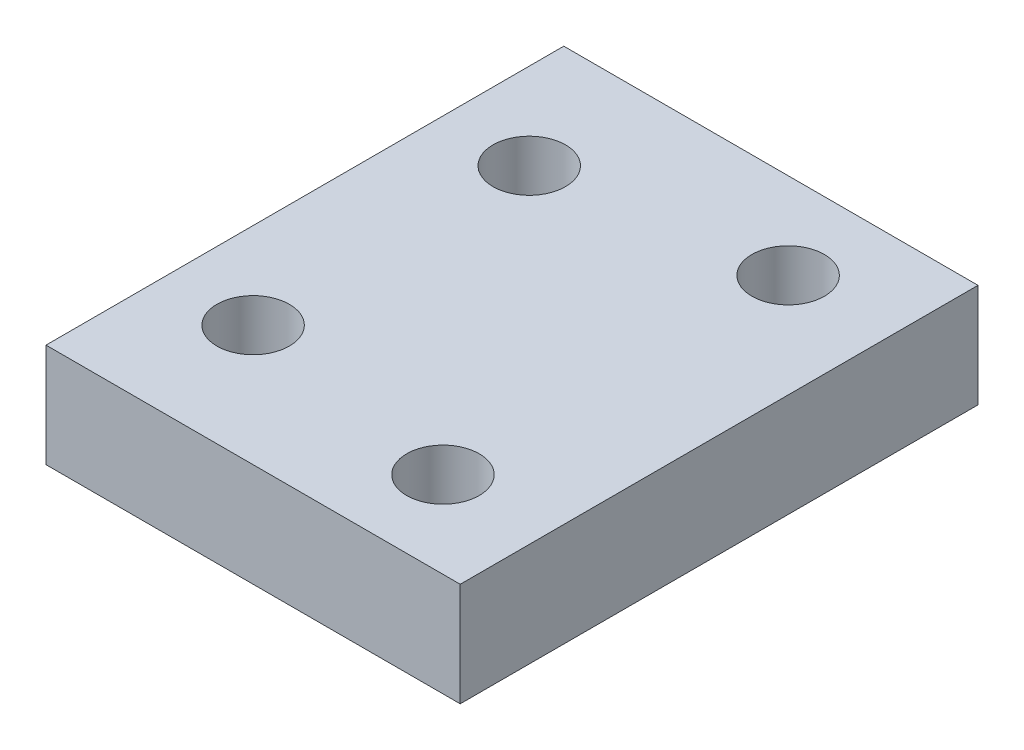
ISO-10303-21;
HEADER;
FILE_DESCRIPTION(('STEP AP214'),'2;1');
FILE_NAME('part.step','',(''),(''),'','','');
FILE_SCHEMA(('AUTOMOTIVE_DESIGN { 1 0 10303 214 1 1 1 1 }'));
ENDSEC;
DATA;
#1=APPLICATION_CONTEXT('core data for automotive mechanical design processes');
#2=APPLICATION_PROTOCOL_DEFINITION('international standard','automotive_design',2000,#1);
#3=PRODUCT_CONTEXT('',#1,'mechanical');
#4=PRODUCT('Part','Part','',(#3));
#5=PRODUCT_RELATED_PRODUCT_CATEGORY('part','',(#4));
#6=PRODUCT_DEFINITION_FORMATION('','',#4);
#7=PRODUCT_DEFINITION_CONTEXT('part definition',#1,'design');
#8=PRODUCT_DEFINITION('design','',#6,#7);
#9=PRODUCT_DEFINITION_SHAPE('','',#8);
#10=(LENGTH_UNIT() NAMED_UNIT(*) SI_UNIT(.MILLI.,.METRE.));
#11=(NAMED_UNIT(*) PLANE_ANGLE_UNIT() SI_UNIT($,.RADIAN.));
#12=(NAMED_UNIT(*) SI_UNIT($,.STERADIAN.) SOLID_ANGLE_UNIT());
#13=UNCERTAINTY_MEASURE_WITH_UNIT(LENGTH_MEASURE(1.E-05),#10,'distance_accuracy_value','');
#14=(GEOMETRIC_REPRESENTATION_CONTEXT(3) GLOBAL_UNCERTAINTY_ASSIGNED_CONTEXT((#13)) GLOBAL_UNIT_ASSIGNED_CONTEXT((#10,
#11,#12)) REPRESENTATION_CONTEXT('',''));
#15=CARTESIAN_POINT('',(0.,0.,0.));
#16=DIRECTION('',(0.,0.,1.));
#17=DIRECTION('',(1.,0.,0.));
#18=AXIS2_PLACEMENT_3D('',#15,#16,#17);
#19=CARTESIAN_POINT('',(0.,6.,0.));
#20=DIRECTION('',(0.,-1.,0.));
#21=DIRECTION('',(0.,0.,-1.));
#22=AXIS2_PLACEMENT_3D('',#19,#20,#21);
#23=PLANE('',#22);
#24=DIRECTION('',(0.,0.,-1.));
#25=VECTOR('',#24,1.);
#26=CARTESIAN_POINT('',(0.,6.,0.));
#27=LINE('',#26,#25);
#28=CARTESIAN_POINT('',(0.,6.,30.));
#29=VERTEX_POINT('',#28);
#30=CARTESIAN_POINT('',(0.,6.,0.));
#31=VERTEX_POINT('',#30);
#32=EDGE_CURVE('E88',#29,#31,#27,.T.);
#33=ORIENTED_EDGE('',*,*,#32,.T.);
#34=DIRECTION('',(-1.,0.,0.));
#35=VECTOR('',#34,1.);
#36=CARTESIAN_POINT('',(0.,6.,0.));
#37=LINE('',#36,#35);
#38=CARTESIAN_POINT('',(-24.,6.,0.));
#39=VERTEX_POINT('',#38);
#40=EDGE_CURVE('E83',#31,#39,#37,.T.);
#41=ORIENTED_EDGE('',*,*,#40,.T.);
#42=DIRECTION('',(0.,0.,1.));
#43=VECTOR('',#42,1.);
#44=CARTESIAN_POINT('',(-24.,6.,0.));
#45=LINE('',#44,#43);
#46=CARTESIAN_POINT('',(-24.,6.,30.));
#47=VERTEX_POINT('',#46);
#48=EDGE_CURVE('E86',#39,#47,#45,.T.);
#49=ORIENTED_EDGE('',*,*,#48,.T.);
#50=DIRECTION('',(1.,0.,0.));
#51=VECTOR('',#50,1.);
#52=CARTESIAN_POINT('',(0.,6.,30.));
#53=LINE('',#52,#51);
#54=EDGE_CURVE('E53',#47,#29,#53,.T.);
#55=ORIENTED_EDGE('',*,*,#54,.T.);
#56=EDGE_LOOP('',(#33,#41,#49,#55));
#57=FACE_BOUND('',#56,.T.);
#58=CARTESIAN_POINT('',(-6.,6.,25.));
#59=DIRECTION('',(0.,1.,0.));
#60=DIRECTION('',(0.,0.,1.));
#61=AXIS2_PLACEMENT_3D('',#58,#59,#60);
#62=CIRCLE('',#61,2.1);
#63=CARTESIAN_POINT('',(-6.,6.,27.1));
#64=VERTEX_POINT('',#63);
#65=EDGE_CURVE('E103',#64,#64,#62,.T.);
#66=ORIENTED_EDGE('',*,*,#65,.F.);
#67=EDGE_LOOP('',(#66));
#68=FACE_BOUND('',#67,.T.);
#69=CARTESIAN_POINT('',(-6.,6.,5.));
#70=DIRECTION('',(0.,1.,0.));
#71=DIRECTION('',(0.,0.,1.));
#72=AXIS2_PLACEMENT_3D('',#69,#70,#71);
#73=CIRCLE('',#72,2.1);
#74=CARTESIAN_POINT('',(-6.,6.,7.1));
#75=VERTEX_POINT('',#74);
#76=EDGE_CURVE('E118',#75,#75,#73,.T.);
#77=ORIENTED_EDGE('',*,*,#76,.F.);
#78=EDGE_LOOP('',(#77));
#79=FACE_BOUND('',#78,.T.);
#80=CARTESIAN_POINT('',(-19.,6.,7.));
#81=DIRECTION('',(0.,1.,0.));
#82=DIRECTION('',(0.,0.,1.));
#83=AXIS2_PLACEMENT_3D('',#80,#81,#82);
#84=CIRCLE('',#83,2.1);
#85=CARTESIAN_POINT('',(-19.,6.,9.1));
#86=VERTEX_POINT('',#85);
#87=EDGE_CURVE('E124',#86,#86,#84,.T.);
#88=ORIENTED_EDGE('',*,*,#87,.F.);
#89=EDGE_LOOP('',(#88));
#90=FACE_BOUND('',#89,.T.);
#91=CARTESIAN_POINT('',(-19.,6.,23.));
#92=DIRECTION('',(0.,1.,0.));
#93=DIRECTION('',(0.,0.,1.));
#94=AXIS2_PLACEMENT_3D('',#91,#92,#93);
#95=CIRCLE('',#94,2.1);
#96=CARTESIAN_POINT('',(-19.,6.,25.1));
#97=VERTEX_POINT('',#96);
#98=EDGE_CURVE('E130',#97,#97,#95,.T.);
#99=ORIENTED_EDGE('',*,*,#98,.F.);
#100=EDGE_LOOP('',(#99));
#101=FACE_BOUND('',#100,.T.);
#102=ADVANCED_FACE('F36',(#57,#68,#79,#90,#101),#23,.F.);
#103=CARTESIAN_POINT('',(0.,0.,0.));
#104=DIRECTION('',(0.,-1.,0.));
#105=DIRECTION('',(0.,0.,-1.));
#106=AXIS2_PLACEMENT_3D('',#103,#104,#105);
#107=PLANE('',#106);
#108=CARTESIAN_POINT('',(-19.,0.,7.));
#109=DIRECTION('',(0.,1.,0.));
#110=DIRECTION('',(0.,0.,1.));
#111=AXIS2_PLACEMENT_3D('',#108,#109,#110);
#112=CIRCLE('',#111,2.1);
#113=CARTESIAN_POINT('',(-19.,0.,9.1));
#114=VERTEX_POINT('',#113);
#115=EDGE_CURVE('E127',#114,#114,#112,.T.);
#116=ORIENTED_EDGE('',*,*,#115,.T.);
#117=EDGE_LOOP('',(#116));
#118=FACE_BOUND('',#117,.T.);
#119=CARTESIAN_POINT('',(-6.,0.,25.));
#120=DIRECTION('',(0.,1.,0.));
#121=DIRECTION('',(0.,0.,1.));
#122=AXIS2_PLACEMENT_3D('',#119,#120,#121);
#123=CIRCLE('',#122,2.1);
#124=CARTESIAN_POINT('',(-6.,0.,27.1));
#125=VERTEX_POINT('',#124);
#126=EDGE_CURVE('E115',#125,#125,#123,.T.);
#127=ORIENTED_EDGE('',*,*,#126,.T.);
#128=EDGE_LOOP('',(#127));
#129=FACE_BOUND('',#128,.T.);
#130=DIRECTION('',(0.,0.,-1.));
#131=VECTOR('',#130,1.);
#132=CARTESIAN_POINT('',(0.,0.,0.));
#133=LINE('',#132,#131);
#134=CARTESIAN_POINT('',(0.,0.,30.));
#135=VERTEX_POINT('',#134);
#136=CARTESIAN_POINT('',(0.,0.,0.));
#137=VERTEX_POINT('',#136);
#138=EDGE_CURVE('E100',#135,#137,#133,.T.);
#139=ORIENTED_EDGE('',*,*,#138,.F.);
#140=DIRECTION('',(1.,0.,0.));
#141=VECTOR('',#140,1.);
#142=CARTESIAN_POINT('',(0.,0.,30.));
#143=LINE('',#142,#141);
#144=CARTESIAN_POINT('',(-24.,0.,30.));
#145=VERTEX_POINT('',#144);
#146=EDGE_CURVE('E76',#145,#135,#143,.T.);
#147=ORIENTED_EDGE('',*,*,#146,.F.);
#148=DIRECTION('',(0.,0.,1.));
#149=VECTOR('',#148,1.);
#150=CARTESIAN_POINT('',(-24.,0.,0.));
#151=LINE('',#150,#149);
#152=CARTESIAN_POINT('',(-24.,0.,0.));
#153=VERTEX_POINT('',#152);
#154=EDGE_CURVE('E70',#153,#145,#151,.T.);
#155=ORIENTED_EDGE('',*,*,#154,.F.);
#156=DIRECTION('',(-1.,0.,0.));
#157=VECTOR('',#156,1.);
#158=CARTESIAN_POINT('',(0.,0.,0.));
#159=LINE('',#158,#157);
#160=EDGE_CURVE('E92',#137,#153,#159,.T.);
#161=ORIENTED_EDGE('',*,*,#160,.F.);
#162=EDGE_LOOP('',(#139,#147,#155,#161));
#163=FACE_BOUND('',#162,.T.);
#164=CARTESIAN_POINT('',(-6.,0.,5.));
#165=DIRECTION('',(0.,1.,0.));
#166=DIRECTION('',(0.,0.,1.));
#167=AXIS2_PLACEMENT_3D('',#164,#165,#166);
#168=CIRCLE('',#167,2.1);
#169=CARTESIAN_POINT('',(-6.,0.,7.1));
#170=VERTEX_POINT('',#169);
#171=EDGE_CURVE('E121',#170,#170,#168,.T.);
#172=ORIENTED_EDGE('',*,*,#171,.T.);
#173=EDGE_LOOP('',(#172));
#174=FACE_BOUND('',#173,.T.);
#175=CARTESIAN_POINT('',(-19.,0.,23.));
#176=DIRECTION('',(0.,1.,0.));
#177=DIRECTION('',(0.,0.,1.));
#178=AXIS2_PLACEMENT_3D('',#175,#176,#177);
#179=CIRCLE('',#178,2.1);
#180=CARTESIAN_POINT('',(-19.,0.,25.1));
#181=VERTEX_POINT('',#180);
#182=EDGE_CURVE('E133',#181,#181,#179,.T.);
#183=ORIENTED_EDGE('',*,*,#182,.T.);
#184=EDGE_LOOP('',(#183));
#185=FACE_BOUND('',#184,.T.);
#186=ADVANCED_FACE('F111',(#118,#129,#163,#174,#185),#107,.T.);
#187=CARTESIAN_POINT('',(0.,6.,0.));
#188=DIRECTION('',(-1.,0.,0.));
#189=DIRECTION('',(0.,0.,1.));
#190=AXIS2_PLACEMENT_3D('',#187,#188,#189);
#191=PLANE('',#190);
#192=ORIENTED_EDGE('',*,*,#138,.T.);
#193=DIRECTION('',(0.,-1.,0.));
#194=VECTOR('',#193,1.);
#195=CARTESIAN_POINT('',(0.,6.,0.));
#196=LINE('',#195,#194);
#197=EDGE_CURVE('E11',#31,#137,#196,.T.);
#198=ORIENTED_EDGE('',*,*,#197,.F.);
#199=ORIENTED_EDGE('',*,*,#32,.F.);
#200=DIRECTION('',(0.,-1.,0.));
#201=VECTOR('',#200,1.);
#202=CARTESIAN_POINT('',(0.,6.,30.));
#203=LINE('',#202,#201);
#204=EDGE_CURVE('E96',#29,#135,#203,.T.);
#205=ORIENTED_EDGE('',*,*,#204,.T.);
#206=EDGE_LOOP('',(#192,#198,#199,#205));
#207=FACE_BOUND('',#206,.T.);
#208=ADVANCED_FACE('F38',(#207),#191,.F.);
#209=CARTESIAN_POINT('',(0.,6.,0.));
#210=DIRECTION('',(0.,0.,1.));
#211=DIRECTION('',(1.,0.,0.));
#212=AXIS2_PLACEMENT_3D('',#209,#210,#211);
#213=PLANE('',#212);
#214=ORIENTED_EDGE('',*,*,#160,.T.);
#215=DIRECTION('',(0.,-1.,0.));
#216=VECTOR('',#215,1.);
#217=CARTESIAN_POINT('',(-24.,6.,0.));
#218=LINE('',#217,#216);
#219=EDGE_CURVE('E45',#39,#153,#218,.T.);
#220=ORIENTED_EDGE('',*,*,#219,.F.);
#221=ORIENTED_EDGE('',*,*,#40,.F.);
#222=ORIENTED_EDGE('',*,*,#197,.T.);
#223=EDGE_LOOP('',(#214,#220,#221,#222));
#224=FACE_BOUND('',#223,.T.);
#225=ADVANCED_FACE('F91',(#224),#213,.F.);
#226=CARTESIAN_POINT('',(-24.,6.,0.));
#227=DIRECTION('',(1.,0.,0.));
#228=DIRECTION('',(0.,0.,-1.));
#229=AXIS2_PLACEMENT_3D('',#226,#227,#228);
#230=PLANE('',#229);
#231=ORIENTED_EDGE('',*,*,#154,.T.);
#232=DIRECTION('',(0.,-1.,0.));
#233=VECTOR('',#232,1.);
#234=CARTESIAN_POINT('',(-24.,6.,30.));
#235=LINE('',#234,#233);
#236=EDGE_CURVE('E93',#47,#145,#235,.T.);
#237=ORIENTED_EDGE('',*,*,#236,.F.);
#238=ORIENTED_EDGE('',*,*,#48,.F.);
#239=ORIENTED_EDGE('',*,*,#219,.T.);
#240=EDGE_LOOP('',(#231,#237,#238,#239));
#241=FACE_BOUND('',#240,.T.);
#242=ADVANCED_FACE('F94',(#241),#230,.F.);
#243=CARTESIAN_POINT('',(0.,6.,30.));
#244=DIRECTION('',(0.,0.,-1.));
#245=DIRECTION('',(-1.,0.,0.));
#246=AXIS2_PLACEMENT_3D('',#243,#244,#245);
#247=PLANE('',#246);
#248=ORIENTED_EDGE('',*,*,#146,.T.);
#249=ORIENTED_EDGE('',*,*,#204,.F.);
#250=ORIENTED_EDGE('',*,*,#54,.F.);
#251=ORIENTED_EDGE('',*,*,#236,.T.);
#252=EDGE_LOOP('',(#248,#249,#250,#251));
#253=FACE_BOUND('',#252,.T.);
#254=ADVANCED_FACE('F108',(#253),#247,.F.);
#255=CARTESIAN_POINT('',(-6.,6.,25.));
#256=DIRECTION('',(0.,-1.,0.));
#257=DIRECTION('',(0.,0.,-1.));
#258=AXIS2_PLACEMENT_3D('',#255,#256,#257);
#259=CYLINDRICAL_SURFACE('',#258,2.1);
#260=ORIENTED_EDGE('',*,*,#65,.T.);
#261=EDGE_LOOP('',(#260));
#262=FACE_BOUND('',#261,.T.);
#263=ORIENTED_EDGE('',*,*,#126,.F.);
#264=EDGE_LOOP('',(#263));
#265=FACE_BOUND('',#264,.T.);
#266=ADVANCED_FACE('F150',(#262,#265),#259,.F.);
#267=CARTESIAN_POINT('',(-6.,6.,5.));
#268=DIRECTION('',(0.,-1.,0.));
#269=DIRECTION('',(0.,0.,-1.));
#270=AXIS2_PLACEMENT_3D('',#267,#268,#269);
#271=CYLINDRICAL_SURFACE('',#270,2.1);
#272=ORIENTED_EDGE('',*,*,#76,.T.);
#273=EDGE_LOOP('',(#272));
#274=FACE_BOUND('',#273,.T.);
#275=ORIENTED_EDGE('',*,*,#171,.F.);
#276=EDGE_LOOP('',(#275));
#277=FACE_BOUND('',#276,.T.);
#278=ADVANCED_FACE('F196',(#274,#277),#271,.F.);
#279=CARTESIAN_POINT('',(-19.,6.,7.));
#280=DIRECTION('',(0.,-1.,0.));
#281=DIRECTION('',(0.,0.,-1.));
#282=AXIS2_PLACEMENT_3D('',#279,#280,#281);
#283=CYLINDRICAL_SURFACE('',#282,2.1);
#284=ORIENTED_EDGE('',*,*,#87,.T.);
#285=EDGE_LOOP('',(#284));
#286=FACE_BOUND('',#285,.T.);
#287=ORIENTED_EDGE('',*,*,#115,.F.);
#288=EDGE_LOOP('',(#287));
#289=FACE_BOUND('',#288,.T.);
#290=ADVANCED_FACE('F204',(#286,#289),#283,.F.);
#291=CARTESIAN_POINT('',(-19.,6.,23.));
#292=DIRECTION('',(0.,-1.,0.));
#293=DIRECTION('',(0.,0.,-1.));
#294=AXIS2_PLACEMENT_3D('',#291,#292,#293);
#295=CYLINDRICAL_SURFACE('',#294,2.1);
#296=ORIENTED_EDGE('',*,*,#98,.T.);
#297=EDGE_LOOP('',(#296));
#298=FACE_BOUND('',#297,.T.);
#299=ORIENTED_EDGE('',*,*,#182,.F.);
#300=EDGE_LOOP('',(#299));
#301=FACE_BOUND('',#300,.T.);
#302=ADVANCED_FACE('F139',(#298,#301),#295,.F.);
#303=CLOSED_SHELL('',(#102,#186,#208,#225,#242,#254,#266,#278,#290,#302));
#304=MANIFOLD_SOLID_BREP('B2',#303);
#305=ADVANCED_BREP_SHAPE_REPRESENTATION('',(#18,#304),#14);
#306=SHAPE_DEFINITION_REPRESENTATION(#9,#305);
ENDSEC;
END-ISO-10303-21;
